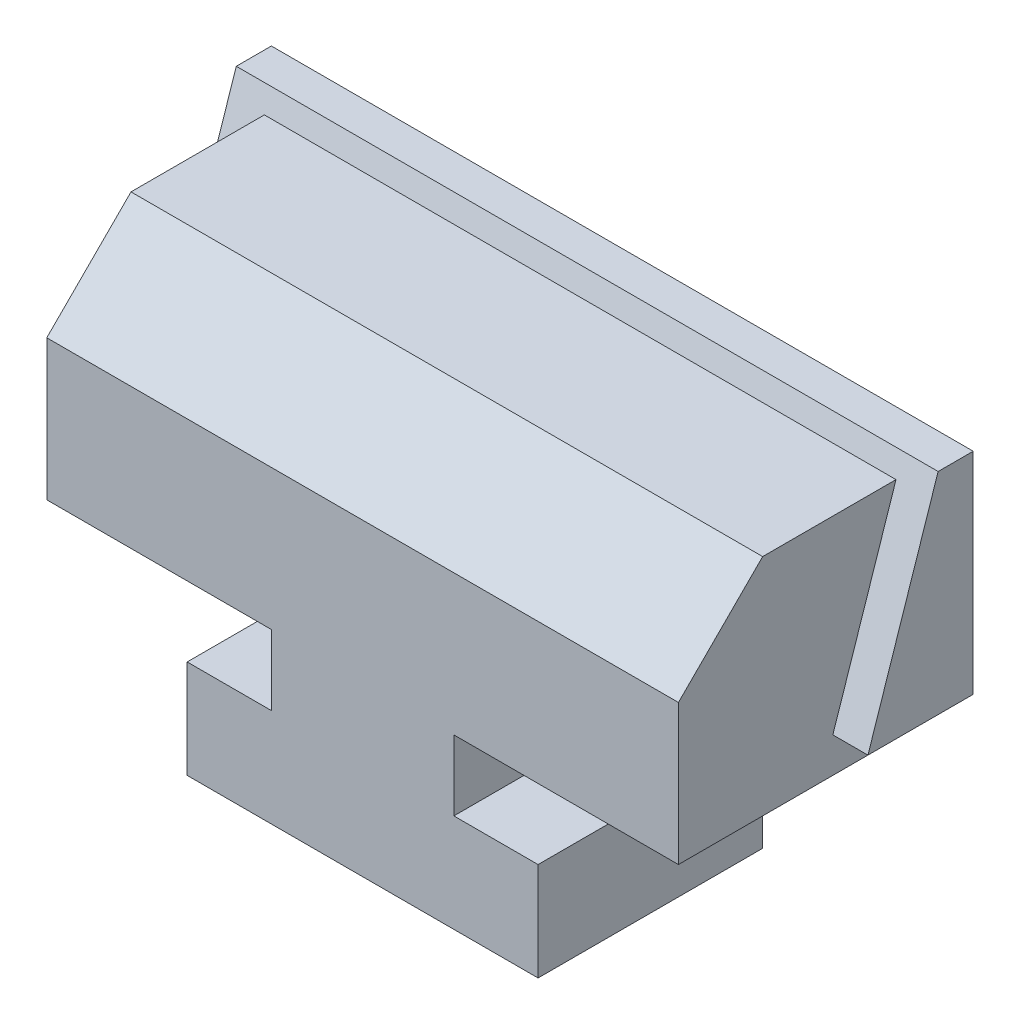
from build123d import *

# Parameters (mm, degrees)
BASE_EXTRUSION_DEPTH    = 37
ESQUISSE2_W             = 5
ESQUISSE2_H             = 29
ENL_V_MAT_EXTRU_1_DEPTH = 113.271991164
BOSS_EXTRU_1_DEPTH      = 5
BOSS_EXTRU_1_DEPTH_BACK = 95
CHANFREIN1_SIZE         = 12


with BuildPart() as part:
    # Esquisse1 → Base-Extrusion (new body)
    with BuildSketch(Plane.XY):
        Polygon((-40, 0), (-90, 0), (-90, 14), (-78, 14), (-78, 24), (-110, 24), (-110, 56), (-20, 56), (-20, 24), (-52, 24), (-52, 14), (-40, 14), align=None)
    extrude(amount=BASE_EXTRUSION_DEPTH)

    # Esquisse2 → Enl_v. mat.-Extru.1 (cut, through all)
    with BuildSketch(Plane.ZY.offset(110)):
        with Locations((2.5, 14.5)):
            Rectangle(ESQUISSE2_W, ESQUISSE2_H)
    extrude(amount=-ENL_V_MAT_EXTRU_1_DEPTH, mode=Mode.SUBTRACT)

    # Esquisse4 → Boss.-Extru.1 (add, two sides: drawn at the far end of the back side and taken through both)
    with BuildSketch(Plane.ZY.offset(110).offset(-BOSS_EXTRU_1_DEPTH_BACK)):
        Polygon((15, 29), (0, 29), (0, 59), (5, 59), align=None)
    extrude(amount=BOSS_EXTRU_1_DEPTH + BOSS_EXTRU_1_DEPTH_BACK)

    # Chanfrein1
    chanfrein1_edges = [part.edges().sort_by_distance(p)[0] for p in [
        (-65, 56, 37),
    ]]
    chamfer(chanfrein1_edges, length=CHANFREIN1_SIZE)


solid = part.part
